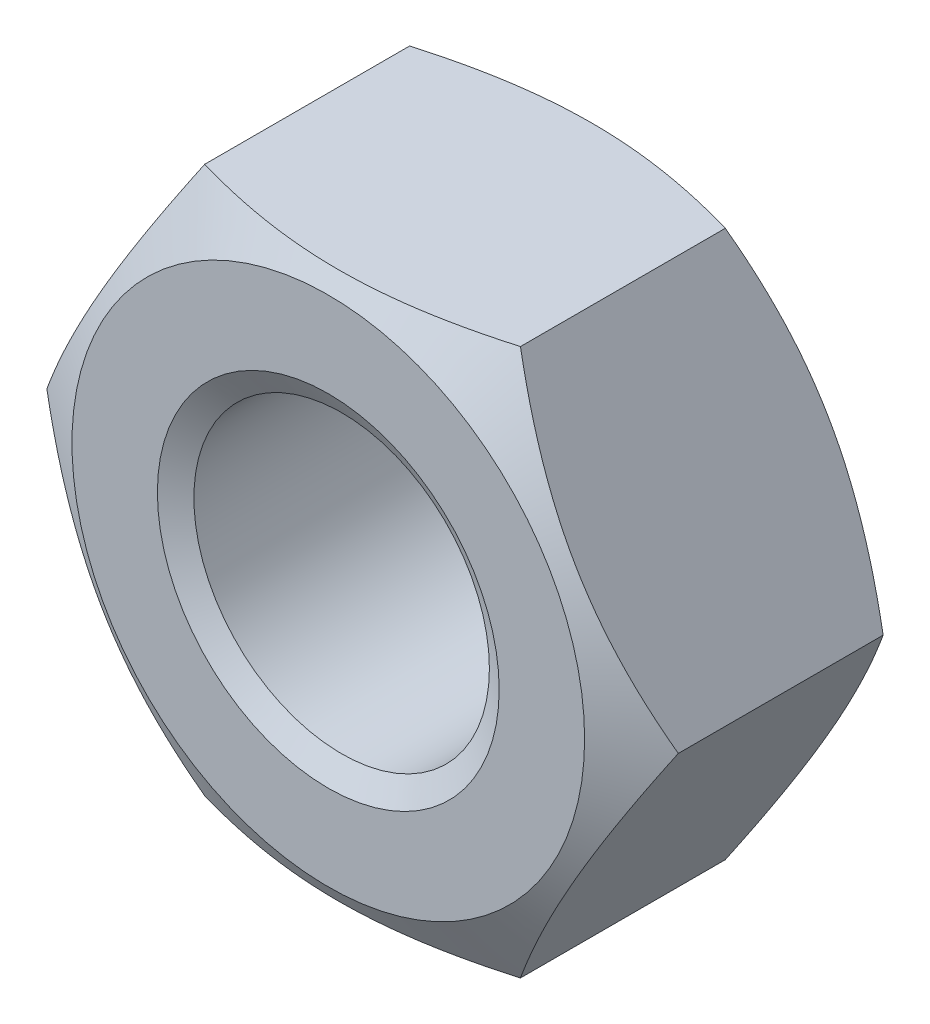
ISO-10303-21;
HEADER;
FILE_DESCRIPTION(('STEP AP214'),'2;1');
FILE_NAME('part.step','',(''),(''),'','','');
FILE_SCHEMA(('AUTOMOTIVE_DESIGN { 1 0 10303 214 1 1 1 1 }'));
ENDSEC;
DATA;
#1=APPLICATION_CONTEXT('core data for automotive mechanical design processes');
#2=APPLICATION_PROTOCOL_DEFINITION('international standard','automotive_design',2000,#1);
#3=PRODUCT_CONTEXT('',#1,'mechanical');
#4=PRODUCT('Part','Part','',(#3));
#5=PRODUCT_RELATED_PRODUCT_CATEGORY('part','',(#4));
#6=PRODUCT_DEFINITION_FORMATION('','',#4);
#7=PRODUCT_DEFINITION_CONTEXT('part definition',#1,'design');
#8=PRODUCT_DEFINITION('design','',#6,#7);
#9=PRODUCT_DEFINITION_SHAPE('','',#8);
#10=(LENGTH_UNIT() NAMED_UNIT(*) SI_UNIT(.MILLI.,.METRE.));
#11=(NAMED_UNIT(*) PLANE_ANGLE_UNIT() SI_UNIT($,.RADIAN.));
#12=(NAMED_UNIT(*) SI_UNIT($,.STERADIAN.) SOLID_ANGLE_UNIT());
#13=UNCERTAINTY_MEASURE_WITH_UNIT(LENGTH_MEASURE(1.E-05),#10,'distance_accuracy_value','');
#14=(GEOMETRIC_REPRESENTATION_CONTEXT(3) GLOBAL_UNCERTAINTY_ASSIGNED_CONTEXT((#13)) GLOBAL_UNIT_ASSIGNED_CONTEXT((#10,
#11,#12)) REPRESENTATION_CONTEXT('',''));
#15=CARTESIAN_POINT('',(0.,0.,0.));
#16=DIRECTION('',(0.,0.,1.));
#17=DIRECTION('',(1.,0.,0.));
#18=AXIS2_PLACEMENT_3D('',#15,#16,#17);
#19=CARTESIAN_POINT('',(0.,0.,0.390613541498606));
#20=DIRECTION('',(0.,0.,-1.));
#21=DIRECTION('',(1.,0.,0.));
#22=AXIS2_PLACEMENT_3D('',#19,#20,#21);
#23=CONICAL_SURFACE('',#22,9.3234375,1.0471975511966);
#24=CARTESIAN_POINT('',(0.,0.,0.781227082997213));
#25=DIRECTION('',(0.,0.,1.));
#26=DIRECTION('',(1.,0.,0.));
#27=AXIS2_PLACEMENT_3D('',#24,#25,#26);
#28=CIRCLE('',#27,8.646875);
#29=CARTESIAN_POINT('',(8.646875,0.,0.781227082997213));
#30=VERTEX_POINT('',#29);
#31=EDGE_CURVE('E11',#30,#30,#28,.T.);
#32=ORIENTED_EDGE('',*,*,#31,.T.);
#33=EDGE_LOOP('',(#32));
#34=FACE_BOUND('',#33,.T.);
#35=CARTESIAN_POINT('',(0.,0.,0.));
#36=DIRECTION('',(0.,0.,1.));
#37=DIRECTION('',(1.,0.,0.));
#38=AXIS2_PLACEMENT_3D('',#35,#36,#37);
#39=CIRCLE('',#38,10.);
#40=CARTESIAN_POINT('',(10.,0.,0.));
#41=VERTEX_POINT('',#40);
#42=EDGE_CURVE('E164',#41,#41,#39,.T.);
#43=ORIENTED_EDGE('',*,*,#42,.F.);
#44=EDGE_LOOP('',(#43));
#45=FACE_BOUND('',#44,.T.);
#46=ADVANCED_FACE('F16',(#34,#45),#23,.F.);
#47=CARTESIAN_POINT('',(0.,0.,8.));
#48=DIRECTION('',(0.,0.,-1.));
#49=DIRECTION('',(1.,0.,0.));
#50=AXIS2_PLACEMENT_3D('',#47,#48,#49);
#51=CYLINDRICAL_SURFACE('',#50,8.646875);
#52=CARTESIAN_POINT('',(0.,0.,15.2187729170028));
#53=DIRECTION('',(0.,0.,1.));
#54=DIRECTION('',(1.,0.,0.));
#55=AXIS2_PLACEMENT_3D('',#52,#53,#54);
#56=CIRCLE('',#55,8.646875);
#57=CARTESIAN_POINT('',(8.646875,0.,15.2187729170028));
#58=VERTEX_POINT('',#57);
#59=EDGE_CURVE('E26',#58,#58,#56,.T.);
#60=ORIENTED_EDGE('',*,*,#59,.T.);
#61=EDGE_LOOP('',(#60));
#62=FACE_BOUND('',#61,.T.);
#63=ORIENTED_EDGE('',*,*,#31,.F.);
#64=EDGE_LOOP('',(#63));
#65=FACE_BOUND('',#64,.T.);
#66=ADVANCED_FACE('F234',(#62,#65),#51,.F.);
#67=CARTESIAN_POINT('',(0.,0.,15.6093864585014));
#68=DIRECTION('',(0.,0.,1.));
#69=DIRECTION('',(1.,0.,0.));
#70=AXIS2_PLACEMENT_3D('',#67,#68,#69);
#71=CONICAL_SURFACE('',#70,9.3234375,1.0471975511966);
#72=CARTESIAN_POINT('',(0.,0.,16.));
#73=DIRECTION('',(0.,0.,-1.));
#74=DIRECTION('',(1.,0.,0.));
#75=AXIS2_PLACEMENT_3D('',#72,#73,#74);
#76=CIRCLE('',#75,10.);
#77=CARTESIAN_POINT('',(10.,0.,16.));
#78=VERTEX_POINT('',#77);
#79=EDGE_CURVE('E117',#78,#78,#76,.T.);
#80=ORIENTED_EDGE('',*,*,#79,.F.);
#81=EDGE_LOOP('',(#80));
#82=FACE_BOUND('',#81,.T.);
#83=ORIENTED_EDGE('',*,*,#59,.F.);
#84=EDGE_LOOP('',(#83));
#85=FACE_BOUND('',#84,.T.);
#86=ADVANCED_FACE('F239',(#82,#85),#71,.F.);
#87=CARTESIAN_POINT('',(0.,0.,1.00320631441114));
#88=DIRECTION('',(0.,0.,1.));
#89=DIRECTION('',(1.,0.,0.));
#90=AXIS2_PLACEMENT_3D('',#87,#88,#89);
#91=CONICAL_SURFACE('',#90,16.737604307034,1.0471975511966);
#92=CARTESIAN_POINT('',(18.475208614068,0.,2.00641262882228));
#93=CARTESIAN_POINT('',(13.856406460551,-8.,-0.660254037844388));
#94=CARTESIAN_POINT('',(9.23760430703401,-16.,2.00641262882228));
#95=(BOUNDED_CURVE() B_SPLINE_CURVE(2,(#92,#93,#94),.UNSPECIFIED.,.F.,
.F.) B_SPLINE_CURVE_WITH_KNOTS((3,3),(0.,18.6949782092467),
.UNSPECIFIED.) CURVE() GEOMETRIC_REPRESENTATION_ITEM() RATIONAL_B_SPLINE_CURVE((1.,
1.15470053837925,1.)) REPRESENTATION_ITEM(''));
#96=CARTESIAN_POINT('',(18.475208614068,0.,2.00641262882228));
#97=VERTEX_POINT('',#96);
#98=CARTESIAN_POINT('',(9.23760430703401,-16.,2.00641262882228));
#99=VERTEX_POINT('',#98);
#100=EDGE_CURVE('E106',#97,#99,#95,.T.);
#101=ORIENTED_EDGE('',*,*,#100,.T.);
#102=CARTESIAN_POINT('',(9.23760430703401,-16.,2.00641262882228));
#103=CARTESIAN_POINT('',(0.,-16.,-0.660254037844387));
#104=CARTESIAN_POINT('',(-9.23760430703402,-16.,2.00641262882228));
#105=(BOUNDED_CURVE() B_SPLINE_CURVE(2,(#102,#103,#104),.UNSPECIFIED.,.F.,
.F.) B_SPLINE_CURVE_WITH_KNOTS((3,3),(0.,18.6949782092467),
.UNSPECIFIED.) CURVE() GEOMETRIC_REPRESENTATION_ITEM() RATIONAL_B_SPLINE_CURVE((1.,
1.15470053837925,1.)) REPRESENTATION_ITEM(''));
#106=CARTESIAN_POINT('',(-9.23760430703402,-16.,2.00641262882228));
#107=VERTEX_POINT('',#106);
#108=EDGE_CURVE('E99',#99,#107,#105,.T.);
#109=ORIENTED_EDGE('',*,*,#108,.T.);
#110=CARTESIAN_POINT('',(-9.23760430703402,-16.,2.00641262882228));
#111=CARTESIAN_POINT('',(-13.856406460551,-8.,-0.660254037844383));
#112=CARTESIAN_POINT('',(-18.475208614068,0.,2.00641262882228));
#113=(BOUNDED_CURVE() B_SPLINE_CURVE(2,(#110,#111,#112),.UNSPECIFIED.,.F.,
.F.) B_SPLINE_CURVE_WITH_KNOTS((3,3),(0.,18.6949782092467),
.UNSPECIFIED.) CURVE() GEOMETRIC_REPRESENTATION_ITEM() RATIONAL_B_SPLINE_CURVE((1.,
1.15470053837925,1.)) REPRESENTATION_ITEM(''));
#114=CARTESIAN_POINT('',(-18.475208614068,0.,2.00641262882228));
#115=VERTEX_POINT('',#114);
#116=EDGE_CURVE('E91',#107,#115,#113,.T.);
#117=ORIENTED_EDGE('',*,*,#116,.T.);
#118=CARTESIAN_POINT('',(-18.475208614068,0.,2.00641262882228));
#119=CARTESIAN_POINT('',(-13.856406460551,8.,-0.660254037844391));
#120=CARTESIAN_POINT('',(-9.237604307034,16.,2.00641262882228));
#121=(BOUNDED_CURVE() B_SPLINE_CURVE(2,(#118,#119,#120),.UNSPECIFIED.,.F.,
.F.) B_SPLINE_CURVE_WITH_KNOTS((3,3),(0.,18.6949782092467),
.UNSPECIFIED.) CURVE() GEOMETRIC_REPRESENTATION_ITEM() RATIONAL_B_SPLINE_CURVE((1.,
1.15470053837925,1.)) REPRESENTATION_ITEM(''));
#122=CARTESIAN_POINT('',(-9.237604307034,16.,2.00641262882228));
#123=VERTEX_POINT('',#122);
#124=EDGE_CURVE('E100',#115,#123,#121,.T.);
#125=ORIENTED_EDGE('',*,*,#124,.T.);
#126=CARTESIAN_POINT('',(-9.23760430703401,16.,2.00641262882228));
#127=CARTESIAN_POINT('',(0.,16.,-0.660254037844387));
#128=CARTESIAN_POINT('',(9.23760430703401,16.,2.00641262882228));
#129=(BOUNDED_CURVE() B_SPLINE_CURVE(2,(#126,#127,#128),.UNSPECIFIED.,.F.,
.F.) B_SPLINE_CURVE_WITH_KNOTS((3,3),(0.,18.6949782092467),
.UNSPECIFIED.) CURVE() GEOMETRIC_REPRESENTATION_ITEM() RATIONAL_B_SPLINE_CURVE((1.,
1.15470053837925,1.)) REPRESENTATION_ITEM(''));
#130=CARTESIAN_POINT('',(9.23760430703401,16.,2.00641262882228));
#131=VERTEX_POINT('',#130);
#132=EDGE_CURVE('E132',#123,#131,#129,.T.);
#133=ORIENTED_EDGE('',*,*,#132,.T.);
#134=CARTESIAN_POINT('',(9.23760430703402,16.,2.00641262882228));
#135=CARTESIAN_POINT('',(13.856406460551,8.,-0.660254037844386));
#136=CARTESIAN_POINT('',(18.475208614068,0.,2.00641262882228));
#137=(BOUNDED_CURVE() B_SPLINE_CURVE(2,(#134,#135,#136),.UNSPECIFIED.,.F.,
.F.) B_SPLINE_CURVE_WITH_KNOTS((3,3),(0.,18.6949782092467),
.UNSPECIFIED.) CURVE() GEOMETRIC_REPRESENTATION_ITEM() RATIONAL_B_SPLINE_CURVE((1.,
1.15470053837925,1.)) REPRESENTATION_ITEM(''));
#138=EDGE_CURVE('E136',#131,#97,#137,.T.);
#139=ORIENTED_EDGE('',*,*,#138,.T.);
#140=EDGE_LOOP('',(#101,#109,#117,#125,#133,#139));
#141=FACE_BOUND('',#140,.T.);
#142=CARTESIAN_POINT('',(0.,0.,0.));
#143=DIRECTION('',(0.,0.,1.));
#144=DIRECTION('',(1.,0.,0.));
#145=AXIS2_PLACEMENT_3D('',#142,#143,#144);
#146=CIRCLE('',#145,15.);
#147=CARTESIAN_POINT('',(15.,0.,0.));
#148=VERTEX_POINT('',#147);
#149=EDGE_CURVE('E141',#148,#148,#146,.T.);
#150=ORIENTED_EDGE('',*,*,#149,.T.);
#151=EDGE_LOOP('',(#150));
#152=FACE_BOUND('',#151,.T.);
#153=ADVANCED_FACE('F103',(#141,#152),#91,.T.);
#154=CARTESIAN_POINT('',(0.,0.,14.9967936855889));
#155=DIRECTION('',(0.,0.,-1.));
#156=DIRECTION('',(1.,0.,0.));
#157=AXIS2_PLACEMENT_3D('',#154,#155,#156);
#158=CONICAL_SURFACE('',#157,16.737604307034,1.0471975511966);
#159=CARTESIAN_POINT('',(9.23760430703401,-16.,13.9935873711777));
#160=CARTESIAN_POINT('',(13.856406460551,-8.,16.6602540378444));
#161=CARTESIAN_POINT('',(18.475208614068,0.,13.9935873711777));
#162=(BOUNDED_CURVE() B_SPLINE_CURVE(2,(#159,#160,#161),.UNSPECIFIED.,.F.,
.F.) B_SPLINE_CURVE_WITH_KNOTS((3,3),(0.,18.6949782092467),
.UNSPECIFIED.) CURVE() GEOMETRIC_REPRESENTATION_ITEM() RATIONAL_B_SPLINE_CURVE((1.,
1.15470053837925,1.)) REPRESENTATION_ITEM(''));
#163=CARTESIAN_POINT('',(9.23760430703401,-16.,13.9935873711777));
#164=VERTEX_POINT('',#163);
#165=CARTESIAN_POINT('',(18.475208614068,0.,13.9935873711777));
#166=VERTEX_POINT('',#165);
#167=EDGE_CURVE('E143',#164,#166,#162,.T.);
#168=ORIENTED_EDGE('',*,*,#167,.T.);
#169=CARTESIAN_POINT('',(18.475208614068,0.,13.9935873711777));
#170=CARTESIAN_POINT('',(13.856406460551,7.99999999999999,16.6602540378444));
#171=CARTESIAN_POINT('',(9.23760430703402,16.,13.9935873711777));
#172=(BOUNDED_CURVE() B_SPLINE_CURVE(2,(#169,#170,#171),.UNSPECIFIED.,.F.,
.F.) B_SPLINE_CURVE_WITH_KNOTS((3,3),(0.,18.6949782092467),
.UNSPECIFIED.) CURVE() GEOMETRIC_REPRESENTATION_ITEM() RATIONAL_B_SPLINE_CURVE((1.,
1.15470053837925,1.)) REPRESENTATION_ITEM(''));
#173=CARTESIAN_POINT('',(9.23760430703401,16.,13.9935873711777));
#174=VERTEX_POINT('',#173);
#175=EDGE_CURVE('E74',#166,#174,#172,.T.);
#176=ORIENTED_EDGE('',*,*,#175,.T.);
#177=CARTESIAN_POINT('',(9.23760430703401,16.,13.9935873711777));
#178=CARTESIAN_POINT('',(0.,16.,16.6602540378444));
#179=CARTESIAN_POINT('',(-9.23760430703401,16.,13.9935873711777));
#180=(BOUNDED_CURVE() B_SPLINE_CURVE(2,(#177,#178,#179),.UNSPECIFIED.,.F.,
.F.) B_SPLINE_CURVE_WITH_KNOTS((3,3),(0.,18.6949782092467),
.UNSPECIFIED.) CURVE() GEOMETRIC_REPRESENTATION_ITEM() RATIONAL_B_SPLINE_CURVE((1.,
1.15470053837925,1.)) REPRESENTATION_ITEM(''));
#181=CARTESIAN_POINT('',(-9.237604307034,16.,13.9935873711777));
#182=VERTEX_POINT('',#181);
#183=EDGE_CURVE('E82',#174,#182,#180,.T.);
#184=ORIENTED_EDGE('',*,*,#183,.T.);
#185=CARTESIAN_POINT('',(-9.23760430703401,16.,13.9935873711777));
#186=CARTESIAN_POINT('',(-13.856406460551,8.00000000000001,16.6602540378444));
#187=CARTESIAN_POINT('',(-18.475208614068,0.,13.9935873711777));
#188=(BOUNDED_CURVE() B_SPLINE_CURVE(2,(#185,#186,#187),.UNSPECIFIED.,.F.,
.F.) B_SPLINE_CURVE_WITH_KNOTS((3,3),(0.,18.6949782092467),
.UNSPECIFIED.) CURVE() GEOMETRIC_REPRESENTATION_ITEM() RATIONAL_B_SPLINE_CURVE((1.,
1.15470053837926,1.)) REPRESENTATION_ITEM(''));
#189=CARTESIAN_POINT('',(-18.475208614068,0.,13.9935873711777));
#190=VERTEX_POINT('',#189);
#191=EDGE_CURVE('E173',#182,#190,#188,.T.);
#192=ORIENTED_EDGE('',*,*,#191,.T.);
#193=CARTESIAN_POINT('',(-18.475208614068,0.,13.9935873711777));
#194=CARTESIAN_POINT('',(-13.856406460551,-7.99999999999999,16.6602540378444));
#195=CARTESIAN_POINT('',(-9.23760430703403,-16.,13.9935873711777));
#196=(BOUNDED_CURVE() B_SPLINE_CURVE(2,(#193,#194,#195),.UNSPECIFIED.,.F.,
.F.) B_SPLINE_CURVE_WITH_KNOTS((3,3),(0.,18.6949782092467),
.UNSPECIFIED.) CURVE() GEOMETRIC_REPRESENTATION_ITEM() RATIONAL_B_SPLINE_CURVE((1.,
1.15470053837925,1.)) REPRESENTATION_ITEM(''));
#197=CARTESIAN_POINT('',(-9.23760430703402,-16.,13.9935873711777));
#198=VERTEX_POINT('',#197);
#199=EDGE_CURVE('E188',#190,#198,#196,.T.);
#200=ORIENTED_EDGE('',*,*,#199,.T.);
#201=CARTESIAN_POINT('',(-9.23760430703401,-16.,13.9935873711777));
#202=CARTESIAN_POINT('',(0.,-16.,16.6602540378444));
#203=CARTESIAN_POINT('',(9.237604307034,-16.,13.9935873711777));
#204=(BOUNDED_CURVE() B_SPLINE_CURVE(2,(#201,#202,#203),.UNSPECIFIED.,.F.,
.F.) B_SPLINE_CURVE_WITH_KNOTS((3,3),(0.,18.6949782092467),
.UNSPECIFIED.) CURVE() GEOMETRIC_REPRESENTATION_ITEM() RATIONAL_B_SPLINE_CURVE((1.,
1.15470053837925,1.)) REPRESENTATION_ITEM(''));
#205=EDGE_CURVE('E113',#198,#164,#204,.T.);
#206=ORIENTED_EDGE('',*,*,#205,.T.);
#207=EDGE_LOOP('',(#168,#176,#184,#192,#200,#206));
#208=FACE_BOUND('',#207,.T.);
#209=CARTESIAN_POINT('',(0.,0.,16.));
#210=DIRECTION('',(0.,0.,-1.));
#211=DIRECTION('',(1.,0.,0.));
#212=AXIS2_PLACEMENT_3D('',#209,#210,#211);
#213=CIRCLE('',#212,15.);
#214=CARTESIAN_POINT('',(15.,0.,16.));
#215=VERTEX_POINT('',#214);
#216=EDGE_CURVE('E20',#215,#215,#213,.T.);
#217=ORIENTED_EDGE('',*,*,#216,.T.);
#218=EDGE_LOOP('',(#217));
#219=FACE_BOUND('',#218,.T.);
#220=ADVANCED_FACE('F215',(#208,#219),#158,.T.);
#221=CARTESIAN_POINT('',(-13.856406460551,8.,0.));
#222=DIRECTION('',(-0.866025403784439,0.5,0.));
#223=DIRECTION('',(-0.5,-0.866025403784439,0.));
#224=AXIS2_PLACEMENT_3D('',#221,#222,#223);
#225=PLANE('',#224);
#226=ORIENTED_EDGE('',*,*,#191,.F.);
#227=DIRECTION('',(0.,0.,1.));
#228=VECTOR('',#227,1.);
#229=CARTESIAN_POINT('',(-9.23760430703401,16.,0.));
#230=LINE('',#229,#228);
#231=EDGE_CURVE('E130',#123,#182,#230,.T.);
#232=ORIENTED_EDGE('',*,*,#231,.F.);
#233=ORIENTED_EDGE('',*,*,#124,.F.);
#234=DIRECTION('',(0.,0.,1.));
#235=VECTOR('',#234,1.);
#236=CARTESIAN_POINT('',(-18.475208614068,0.,0.));
#237=LINE('',#236,#235);
#238=EDGE_CURVE('E96',#115,#190,#237,.T.);
#239=ORIENTED_EDGE('',*,*,#238,.T.);
#240=EDGE_LOOP('',(#226,#232,#233,#239));
#241=FACE_BOUND('',#240,.T.);
#242=ADVANCED_FACE('F213',(#241),#225,.T.);
#243=CARTESIAN_POINT('',(0.,16.,0.));
#244=DIRECTION('',(0.,1.,0.));
#245=DIRECTION('',(-1.,0.,0.));
#246=AXIS2_PLACEMENT_3D('',#243,#244,#245);
#247=PLANE('',#246);
#248=ORIENTED_EDGE('',*,*,#183,.F.);
#249=DIRECTION('',(0.,0.,1.));
#250=VECTOR('',#249,1.);
#251=CARTESIAN_POINT('',(9.23760430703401,16.,0.));
#252=LINE('',#251,#250);
#253=EDGE_CURVE('E129',#131,#174,#252,.T.);
#254=ORIENTED_EDGE('',*,*,#253,.F.);
#255=ORIENTED_EDGE('',*,*,#132,.F.);
#256=ORIENTED_EDGE('',*,*,#231,.T.);
#257=EDGE_LOOP('',(#248,#254,#255,#256));
#258=FACE_BOUND('',#257,.T.);
#259=ADVANCED_FACE('F211',(#258),#247,.T.);
#260=CARTESIAN_POINT('',(13.856406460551,8.,0.));
#261=DIRECTION('',(0.866025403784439,0.5,0.));
#262=DIRECTION('',(-0.5,0.866025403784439,0.));
#263=AXIS2_PLACEMENT_3D('',#260,#261,#262);
#264=PLANE('',#263);
#265=ORIENTED_EDGE('',*,*,#175,.F.);
#266=DIRECTION('',(0.,0.,1.));
#267=VECTOR('',#266,1.);
#268=CARTESIAN_POINT('',(18.475208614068,0.,0.));
#269=LINE('',#268,#267);
#270=EDGE_CURVE('E131',#97,#166,#269,.T.);
#271=ORIENTED_EDGE('',*,*,#270,.F.);
#272=ORIENTED_EDGE('',*,*,#138,.F.);
#273=ORIENTED_EDGE('',*,*,#253,.T.);
#274=EDGE_LOOP('',(#265,#271,#272,#273));
#275=FACE_BOUND('',#274,.T.);
#276=ADVANCED_FACE('F218',(#275),#264,.T.);
#277=CARTESIAN_POINT('',(13.856406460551,-8.,0.));
#278=DIRECTION('',(0.866025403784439,-0.5,0.));
#279=DIRECTION('',(0.5,0.866025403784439,0.));
#280=AXIS2_PLACEMENT_3D('',#277,#278,#279);
#281=PLANE('',#280);
#282=ORIENTED_EDGE('',*,*,#167,.F.);
#283=DIRECTION('',(0.,0.,1.));
#284=VECTOR('',#283,1.);
#285=CARTESIAN_POINT('',(9.23760430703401,-16.,0.));
#286=LINE('',#285,#284);
#287=EDGE_CURVE('E115',#99,#164,#286,.T.);
#288=ORIENTED_EDGE('',*,*,#287,.F.);
#289=ORIENTED_EDGE('',*,*,#100,.F.);
#290=ORIENTED_EDGE('',*,*,#270,.T.);
#291=EDGE_LOOP('',(#282,#288,#289,#290));
#292=FACE_BOUND('',#291,.T.);
#293=ADVANCED_FACE('F220',(#292),#281,.T.);
#294=CARTESIAN_POINT('',(0.,0.,0.));
#295=DIRECTION('',(0.,0.,1.));
#296=DIRECTION('',(0.,-1.,0.));
#297=AXIS2_PLACEMENT_3D('',#294,#295,#296);
#298=PLANE('',#297);
#299=ORIENTED_EDGE('',*,*,#42,.T.);
#300=EDGE_LOOP('',(#299));
#301=FACE_BOUND('',#300,.T.);
#302=ORIENTED_EDGE('',*,*,#149,.F.);
#303=EDGE_LOOP('',(#302));
#304=FACE_BOUND('',#303,.T.);
#305=ADVANCED_FACE('F222',(#301,#304),#298,.F.);
#306=CARTESIAN_POINT('',(0.,0.,16.));
#307=DIRECTION('',(0.,0.,1.));
#308=DIRECTION('',(0.,-1.,0.));
#309=AXIS2_PLACEMENT_3D('',#306,#307,#308);
#310=PLANE('',#309);
#311=ORIENTED_EDGE('',*,*,#79,.T.);
#312=EDGE_LOOP('',(#311));
#313=FACE_BOUND('',#312,.T.);
#314=ORIENTED_EDGE('',*,*,#216,.F.);
#315=EDGE_LOOP('',(#314));
#316=FACE_BOUND('',#315,.T.);
#317=ADVANCED_FACE('F229',(#313,#316),#310,.T.);
#318=CARTESIAN_POINT('',(0.,-16.,0.));
#319=DIRECTION('',(0.,-1.,0.));
#320=DIRECTION('',(1.,0.,0.));
#321=AXIS2_PLACEMENT_3D('',#318,#319,#320);
#322=PLANE('',#321);
#323=ORIENTED_EDGE('',*,*,#205,.F.);
#324=DIRECTION('',(0.,0.,1.));
#325=VECTOR('',#324,1.);
#326=CARTESIAN_POINT('',(-9.23760430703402,-16.,0.));
#327=LINE('',#326,#325);
#328=EDGE_CURVE('E94',#107,#198,#327,.T.);
#329=ORIENTED_EDGE('',*,*,#328,.F.);
#330=ORIENTED_EDGE('',*,*,#108,.F.);
#331=ORIENTED_EDGE('',*,*,#287,.T.);
#332=EDGE_LOOP('',(#323,#329,#330,#331));
#333=FACE_BOUND('',#332,.T.);
#334=ADVANCED_FACE('F112',(#333),#322,.T.);
#335=CARTESIAN_POINT('',(-13.856406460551,-8.,0.));
#336=DIRECTION('',(-0.866025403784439,-0.5,0.));
#337=DIRECTION('',(0.5,-0.866025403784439,0.));
#338=AXIS2_PLACEMENT_3D('',#335,#336,#337);
#339=PLANE('',#338);
#340=ORIENTED_EDGE('',*,*,#199,.F.);
#341=ORIENTED_EDGE('',*,*,#238,.F.);
#342=ORIENTED_EDGE('',*,*,#116,.F.);
#343=ORIENTED_EDGE('',*,*,#328,.T.);
#344=EDGE_LOOP('',(#340,#341,#342,#343));
#345=FACE_BOUND('',#344,.T.);
#346=ADVANCED_FACE('F18',(#345),#339,.T.);
#347=CLOSED_SHELL('',(#46,#66,#86,#153,#220,#242,#259,#276,#293,#305,#317,#334,#346));
#348=MANIFOLD_SOLID_BREP('B1',#347);
#349=ADVANCED_BREP_SHAPE_REPRESENTATION('',(#18,#348),#14);
#350=SHAPE_DEFINITION_REPRESENTATION(#9,#349);
ENDSEC;
END-ISO-10303-21;
